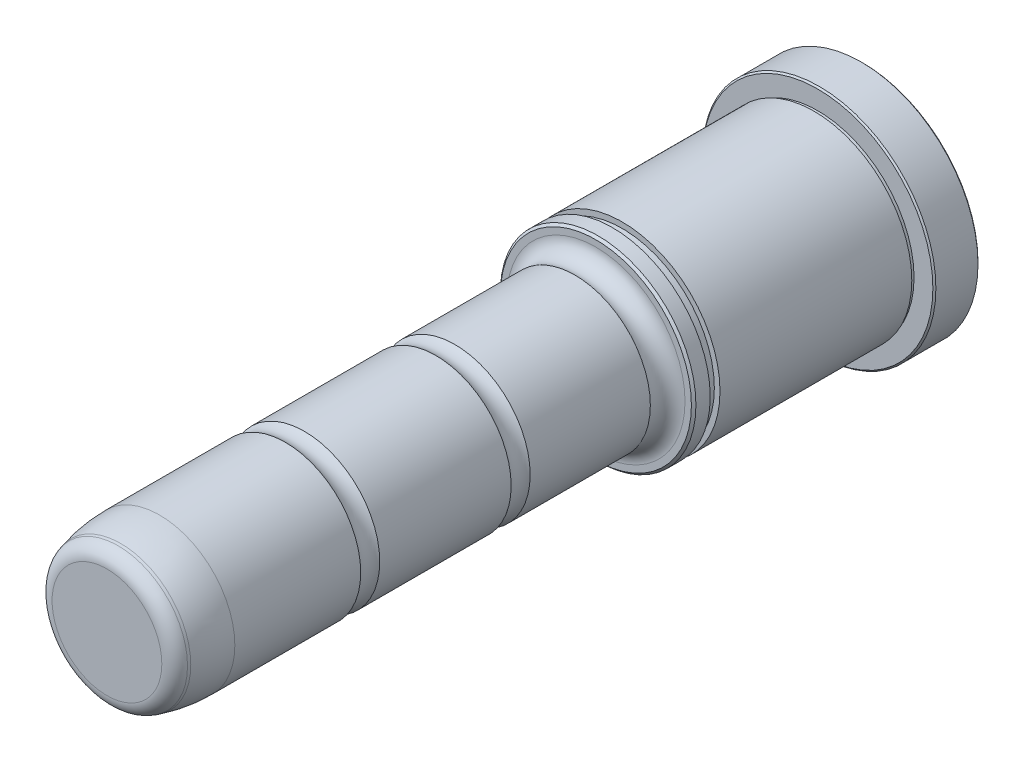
from build123d import *

# Parameters (mm, degrees)
SKETCH3_W       = 1.3
SKETCH3_H       = 0.75
LPATTERN1_COUNT = 2
LPATTERN1_PITCH = 20


with BuildPart() as part:
    # Sketch1 → Revolve1 (revolve)
    with BuildSketch(Plane(origin=(0, 0, 0), x_dir=(0, 0, -1), z_dir=(1, 0, 0)), mode=Mode.PRIVATE) as revolve1_sk:
        with BuildLine():
            Line((-35.75, 12.7), (-35.45, 13))
            Line((-35.45, 13), (-6.75, 13))
            Line((-6.75, 13), (-6.75, 12.8))
            Line((-6.75, 12.8), (-6.25, 12.8))
            Line((-6.25, 12.8), (-6.25, 15.3))
            Line((-6.25, 15.3), (-6.05, 15.5))
            Line((-6.05, 15.5), (-0.45, 15.5))
            Line((-0.45, 15.5), (-0.25, 15.3))
            Line((-0.25, 15.3), (-0.25, 0))
            Line((-0.25, 0), (-100.75, 0))
            Line((-100.75, 0), (-100.75, 7.295225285))
            ThreePointArc((-100.75, 7.295225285), (-100.336706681, 8.512748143), (-99.26763809, 9.227076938))
            Line((-99.26763809, 9.227076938), (-98.926380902, 9.318516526))
            ThreePointArc((-98.926380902, 9.318516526), (-96.360523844, 9.828897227), (-93.75, 10))
            Line((-93.75, 10), (-38.509934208, 10))
            ThreePointArc((-38.509934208, 10), (-36.636417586, 10.188695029), (-35.75, 11.85))
            Line((-35.75, 11.85), (-35.75, 12.7))
        make_face()
    revolve(revolve1_sk.sketch.rotate(Axis((0, 0, 0.25), (0, 0, -1)), 90), axis=Axis((0, 0, 0.25), (0, 0, -1)))

    # Sketch2 → Cut-Revolve1 (revolve, cut)
    with BuildSketch(Plane(origin=(0, 0, 0), x_dir=(0, 0, -1), z_dir=(1, 0, 0)), mode=Mode.PRIVATE) as cut_revolve1_sk:
        with BuildLine():
            Line((-77.014911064, 10), (-74.485088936, 10))
            ThreePointArc((-74.485088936, 10), (-75.75, 9.6), (-77.014911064, 10))
        make_face()
    cut_revolve1 = revolve(cut_revolve1_sk.sketch.rotate(Axis((0, 0, 100.75), (0, 0, -1)), 90), axis=Axis((0, 0, 100.75), (0, 0, -1)), mode=Mode.SUBTRACT)

    # Sketch3 → Cut-Revolve2 (revolve, cut)
    with BuildSketch(Plane(origin=(0, 0, 0), x_dir=(0, 0, -1), z_dir=(1, 0, 0)), mode=Mode.PRIVATE) as cut_revolve2_sk:
        with Locations((-32.9, 12.625)):
            Rectangle(SKETCH3_W, SKETCH3_H)
    revolve(cut_revolve2_sk.sketch.rotate(Axis((0, 0, 100.75), (0, 0, -1)), 90), axis=Axis((0, 0, 100.75), (0, 0, -1)), mode=Mode.SUBTRACT)

    # LPattern1: Cut-Revolve1 ×2
    with Locations(*[(0, 0, -i * LPATTERN1_PITCH) for i in range(1, LPATTERN1_COUNT)]):
        add(cut_revolve1, mode=Mode.SUBTRACT)


solid = part.part
